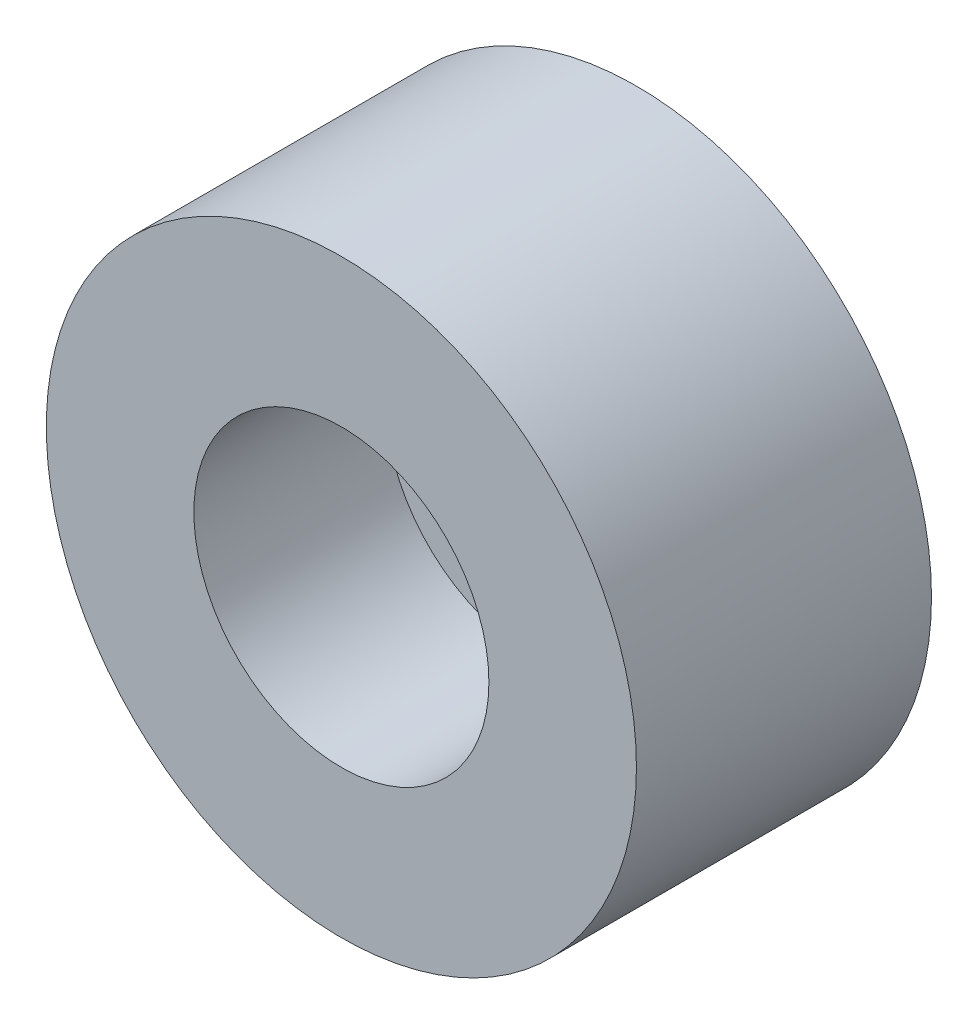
ISO-10303-21;
HEADER;
FILE_DESCRIPTION(('STEP AP214'),'2;1');
FILE_NAME('part.step','',(''),(''),'','','');
FILE_SCHEMA(('AUTOMOTIVE_DESIGN { 1 0 10303 214 1 1 1 1 }'));
ENDSEC;
DATA;
#1=APPLICATION_CONTEXT('core data for automotive mechanical design processes');
#2=APPLICATION_PROTOCOL_DEFINITION('international standard','automotive_design',2000,#1);
#3=PRODUCT_CONTEXT('',#1,'mechanical');
#4=PRODUCT('Part','Part','',(#3));
#5=PRODUCT_RELATED_PRODUCT_CATEGORY('part','',(#4));
#6=PRODUCT_DEFINITION_FORMATION('','',#4);
#7=PRODUCT_DEFINITION_CONTEXT('part definition',#1,'design');
#8=PRODUCT_DEFINITION('design','',#6,#7);
#9=PRODUCT_DEFINITION_SHAPE('','',#8);
#10=(LENGTH_UNIT() NAMED_UNIT(*) SI_UNIT(.MILLI.,.METRE.));
#11=(NAMED_UNIT(*) PLANE_ANGLE_UNIT() SI_UNIT($,.RADIAN.));
#12=(NAMED_UNIT(*) SI_UNIT($,.STERADIAN.) SOLID_ANGLE_UNIT());
#13=UNCERTAINTY_MEASURE_WITH_UNIT(LENGTH_MEASURE(1.E-05),#10,'distance_accuracy_value','');
#14=(GEOMETRIC_REPRESENTATION_CONTEXT(3) GLOBAL_UNCERTAINTY_ASSIGNED_CONTEXT((#13)) GLOBAL_UNIT_ASSIGNED_CONTEXT((#10,
#11,#12)) REPRESENTATION_CONTEXT('',''));
#15=CARTESIAN_POINT('',(0.,0.,0.));
#16=DIRECTION('',(0.,0.,1.));
#17=DIRECTION('',(1.,0.,0.));
#18=AXIS2_PLACEMENT_3D('',#15,#16,#17);
#19=CARTESIAN_POINT('',(10.,0.,7.));
#20=DIRECTION('',(0.,0.,-1.));
#21=DIRECTION('',(-1.,0.,0.));
#22=AXIS2_PLACEMENT_3D('',#19,#20,#21);
#23=PLANE('',#22);
#24=CARTESIAN_POINT('',(0.,0.,7.));
#25=DIRECTION('',(0.,0.,1.));
#26=DIRECTION('',(1.,0.,0.));
#27=AXIS2_PLACEMENT_3D('',#24,#25,#26);
#28=CIRCLE('',#27,7.);
#29=CARTESIAN_POINT('',(7.,0.,7.));
#30=VERTEX_POINT('',#29);
#31=EDGE_CURVE('E8',#30,#30,#28,.T.);
#32=ORIENTED_EDGE('',*,*,#31,.F.);
#33=EDGE_LOOP('',(#32));
#34=FACE_BOUND('',#33,.T.);
#35=CARTESIAN_POINT('',(0.,0.,7.));
#36=DIRECTION('',(0.,0.,1.));
#37=DIRECTION('',(1.,0.,0.));
#38=AXIS2_PLACEMENT_3D('',#35,#36,#37);
#39=CIRCLE('',#38,10.);
#40=CARTESIAN_POINT('',(10.,0.,7.));
#41=VERTEX_POINT('',#40);
#42=EDGE_CURVE('E34',#41,#41,#39,.T.);
#43=ORIENTED_EDGE('',*,*,#42,.T.);
#44=EDGE_LOOP('',(#43));
#45=FACE_BOUND('',#44,.T.);
#46=ADVANCED_FACE('F12',(#34,#45),#23,.F.);
#47=CARTESIAN_POINT('',(0.,0.,40.));
#48=DIRECTION('',(0.,0.,1.));
#49=DIRECTION('',(1.,0.,0.));
#50=AXIS2_PLACEMENT_3D('',#47,#48,#49);
#51=CYLINDRICAL_SURFACE('',#50,7.);
#52=CARTESIAN_POINT('',(0.,0.,0.));
#53=DIRECTION('',(0.,0.,1.));
#54=DIRECTION('',(1.,0.,0.));
#55=AXIS2_PLACEMENT_3D('',#52,#53,#54);
#56=CIRCLE('',#55,7.);
#57=CARTESIAN_POINT('',(7.,0.,0.));
#58=VERTEX_POINT('',#57);
#59=EDGE_CURVE('E18',#58,#58,#56,.T.);
#60=ORIENTED_EDGE('',*,*,#59,.F.);
#61=EDGE_LOOP('',(#60));
#62=FACE_BOUND('',#61,.T.);
#63=ORIENTED_EDGE('',*,*,#31,.T.);
#64=EDGE_LOOP('',(#63));
#65=FACE_BOUND('',#64,.T.);
#66=ADVANCED_FACE('F59',(#62,#65),#51,.F.);
#67=CARTESIAN_POINT('',(7.,0.,0.));
#68=DIRECTION('',(0.,0.,1.));
#69=DIRECTION('',(1.,0.,0.));
#70=AXIS2_PLACEMENT_3D('',#67,#68,#69);
#71=PLANE('',#70);
#72=CARTESIAN_POINT('',(0.,0.,0.));
#73=DIRECTION('',(0.,0.,1.));
#74=DIRECTION('',(1.,0.,0.));
#75=AXIS2_PLACEMENT_3D('',#72,#73,#74);
#76=CIRCLE('',#75,20.);
#77=CARTESIAN_POINT('',(20.,0.,0.));
#78=VERTEX_POINT('',#77);
#79=EDGE_CURVE('E22',#78,#78,#76,.T.);
#80=ORIENTED_EDGE('',*,*,#79,.F.);
#81=EDGE_LOOP('',(#80));
#82=FACE_BOUND('',#81,.T.);
#83=ORIENTED_EDGE('',*,*,#59,.T.);
#84=EDGE_LOOP('',(#83));
#85=FACE_BOUND('',#84,.T.);
#86=ADVANCED_FACE('F54',(#82,#85),#71,.F.);
#87=CARTESIAN_POINT('',(0.,0.,40.));
#88=DIRECTION('',(0.,0.,1.));
#89=DIRECTION('',(1.,0.,0.));
#90=AXIS2_PLACEMENT_3D('',#87,#88,#89);
#91=CYLINDRICAL_SURFACE('',#90,20.);
#92=CARTESIAN_POINT('',(0.,0.,20.));
#93=DIRECTION('',(0.,0.,1.));
#94=DIRECTION('',(1.,0.,0.));
#95=AXIS2_PLACEMENT_3D('',#92,#93,#94);
#96=CIRCLE('',#95,20.);
#97=CARTESIAN_POINT('',(20.,0.,20.));
#98=VERTEX_POINT('',#97);
#99=EDGE_CURVE('E26',#98,#98,#96,.T.);
#100=ORIENTED_EDGE('',*,*,#99,.F.);
#101=EDGE_LOOP('',(#100));
#102=FACE_BOUND('',#101,.T.);
#103=ORIENTED_EDGE('',*,*,#79,.T.);
#104=EDGE_LOOP('',(#103));
#105=FACE_BOUND('',#104,.T.);
#106=ADVANCED_FACE('F48',(#102,#105),#91,.T.);
#107=CARTESIAN_POINT('',(20.,0.,20.));
#108=DIRECTION('',(0.,0.,-1.));
#109=DIRECTION('',(-1.,0.,0.));
#110=AXIS2_PLACEMENT_3D('',#107,#108,#109);
#111=PLANE('',#110);
#112=CARTESIAN_POINT('',(0.,0.,20.));
#113=DIRECTION('',(0.,0.,1.));
#114=DIRECTION('',(1.,0.,0.));
#115=AXIS2_PLACEMENT_3D('',#112,#113,#114);
#116=CIRCLE('',#115,10.);
#117=CARTESIAN_POINT('',(10.,0.,20.));
#118=VERTEX_POINT('',#117);
#119=EDGE_CURVE('E31',#118,#118,#116,.T.);
#120=ORIENTED_EDGE('',*,*,#119,.F.);
#121=EDGE_LOOP('',(#120));
#122=FACE_BOUND('',#121,.T.);
#123=ORIENTED_EDGE('',*,*,#99,.T.);
#124=EDGE_LOOP('',(#123));
#125=FACE_BOUND('',#124,.T.);
#126=ADVANCED_FACE('F42',(#122,#125),#111,.F.);
#127=CARTESIAN_POINT('',(0.,0.,40.));
#128=DIRECTION('',(0.,0.,1.));
#129=DIRECTION('',(1.,0.,0.));
#130=AXIS2_PLACEMENT_3D('',#127,#128,#129);
#131=CYLINDRICAL_SURFACE('',#130,10.);
#132=ORIENTED_EDGE('',*,*,#42,.F.);
#133=EDGE_LOOP('',(#132));
#134=FACE_BOUND('',#133,.T.);
#135=ORIENTED_EDGE('',*,*,#119,.T.);
#136=EDGE_LOOP('',(#135));
#137=FACE_BOUND('',#136,.T.);
#138=ADVANCED_FACE('F39',(#134,#137),#131,.F.);
#139=CLOSED_SHELL('',(#46,#66,#86,#106,#126,#138));
#140=MANIFOLD_SOLID_BREP('B1',#139);
#141=ADVANCED_BREP_SHAPE_REPRESENTATION('',(#18,#140),#14);
#142=SHAPE_DEFINITION_REPRESENTATION(#9,#141);
ENDSEC;
END-ISO-10303-21;
